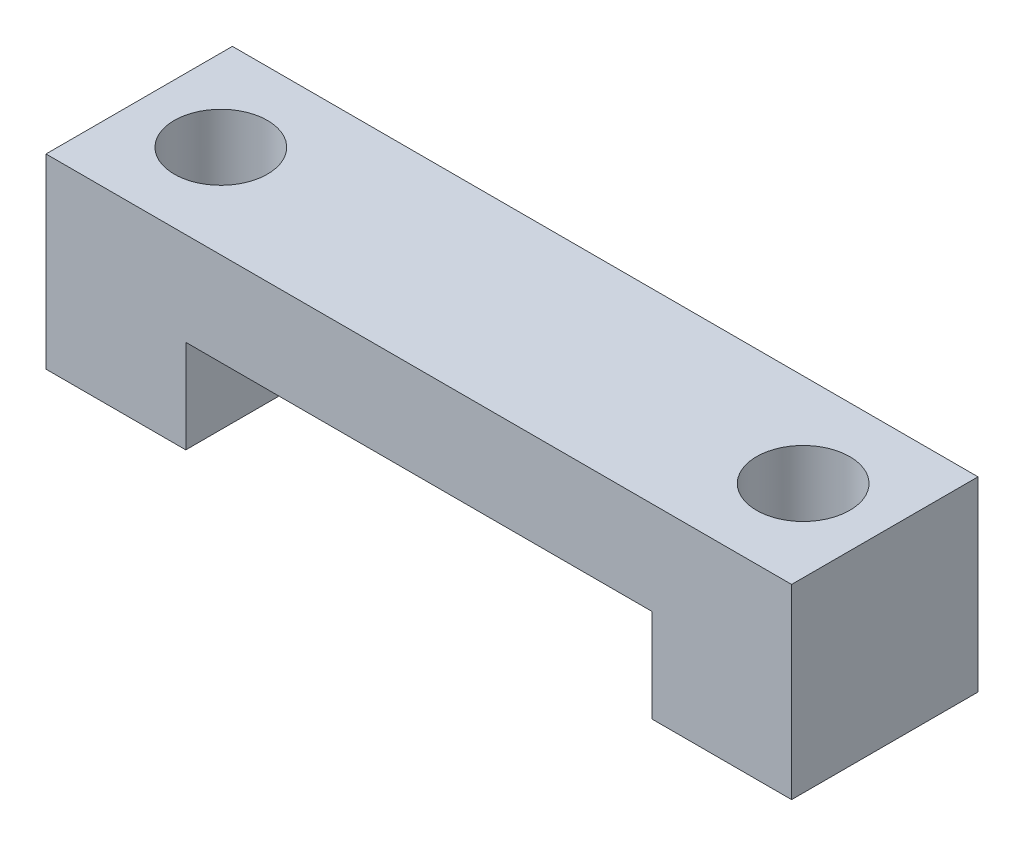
from build123d import *

# Parameters (mm, degrees)
BOSS_EXTRUDE1_DEPTH = 6.35
SKETCH3_R           = 3.175
CUT_EXTRUDE1_DEPTH  = 25.4


with BuildPart() as part:
    # Sketch2 → Boss-Extrude1 (new, symmetric)
    with BuildSketch(Plane.XY):
        Polygon((-15.875, 0), (-25.4, 0), (-25.4, 12.7), (25.4, 12.7), (25.4, 0), (15.875, 0), (15.875, 6.35), (-15.875, 6.35), align=None)
    extrude(amount=BOSS_EXTRUDE1_DEPTH, both=True)

    # Sketch3 → Cut-Extrude1 (cut)
    with BuildSketch(Plane(origin=(0, 0, 0), x_dir=(1, 0, 0), z_dir=(0, 1, 0))):
        with Locations(Location((-19.8374, 0, 0), (0, 0, 90))):
            Circle(SKETCH3_R)
        with Locations(Location((19.8374, 0, 0), (0, 0, 90))):
            Circle(SKETCH3_R)
    extrude(amount=CUT_EXTRUDE1_DEPTH, mode=Mode.SUBTRACT)


solid = part.part
